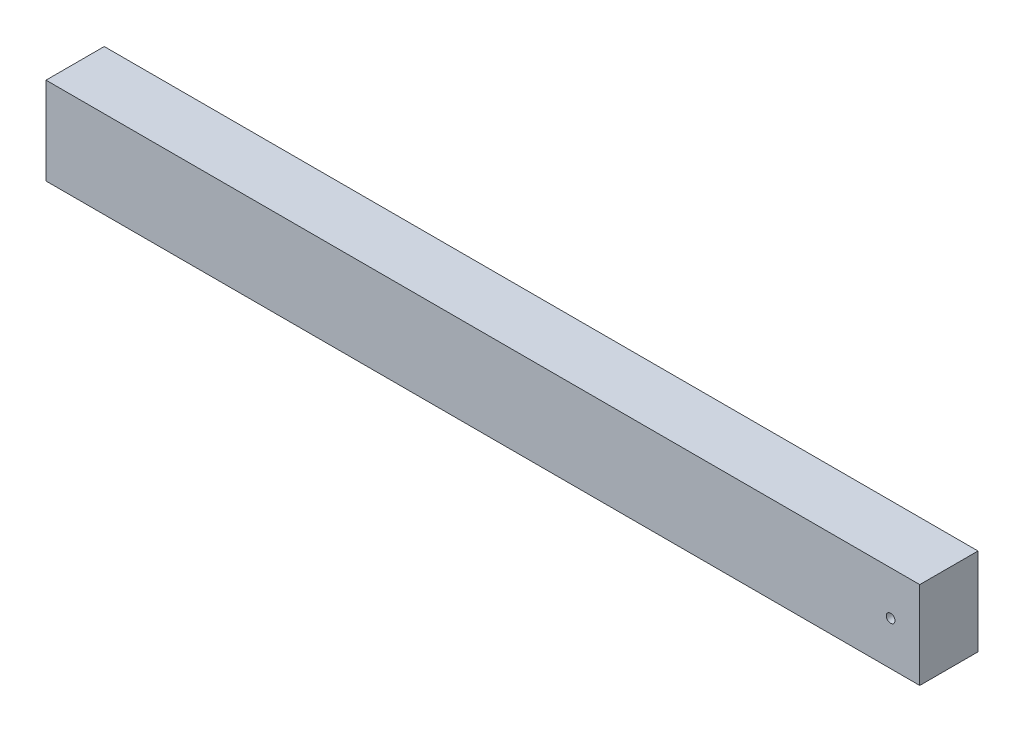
ISO-10303-21;
HEADER;
FILE_DESCRIPTION(('STEP AP214'),'2;1');
FILE_NAME('part.step','',(''),(''),'','','');
FILE_SCHEMA(('AUTOMOTIVE_DESIGN { 1 0 10303 214 1 1 1 1 }'));
ENDSEC;
DATA;
#1=APPLICATION_CONTEXT('core data for automotive mechanical design processes');
#2=APPLICATION_PROTOCOL_DEFINITION('international standard','automotive_design',2000,#1);
#3=PRODUCT_CONTEXT('',#1,'mechanical');
#4=PRODUCT('Part','Part','',(#3));
#5=PRODUCT_RELATED_PRODUCT_CATEGORY('part','',(#4));
#6=PRODUCT_DEFINITION_FORMATION('','',#4);
#7=PRODUCT_DEFINITION_CONTEXT('part definition',#1,'design');
#8=PRODUCT_DEFINITION('design','',#6,#7);
#9=PRODUCT_DEFINITION_SHAPE('','',#8);
#10=(LENGTH_UNIT() NAMED_UNIT(*) SI_UNIT(.MILLI.,.METRE.));
#11=(NAMED_UNIT(*) PLANE_ANGLE_UNIT() SI_UNIT($,.RADIAN.));
#12=(NAMED_UNIT(*) SI_UNIT($,.STERADIAN.) SOLID_ANGLE_UNIT());
#13=UNCERTAINTY_MEASURE_WITH_UNIT(LENGTH_MEASURE(1.E-05),#10,'distance_accuracy_value','');
#14=(GEOMETRIC_REPRESENTATION_CONTEXT(3) GLOBAL_UNCERTAINTY_ASSIGNED_CONTEXT((#13)) GLOBAL_UNIT_ASSIGNED_CONTEXT((#10,
#11,#12)) REPRESENTATION_CONTEXT('',''));
#15=CARTESIAN_POINT('',(0.,0.,0.));
#16=DIRECTION('',(0.,0.,1.));
#17=DIRECTION('',(1.,0.,0.));
#18=AXIS2_PLACEMENT_3D('',#15,#16,#17);
#19=CARTESIAN_POINT('',(0.,0.,20.));
#20=DIRECTION('',(0.,0.,1.));
#21=DIRECTION('',(1.,0.,0.));
#22=AXIS2_PLACEMENT_3D('',#19,#20,#21);
#23=PLANE('',#22);
#24=DIRECTION('',(0.,-1.,0.));
#25=VECTOR('',#24,1.);
#26=CARTESIAN_POINT('',(-300.,-30.,20.));
#27=LINE('',#26,#25);
#28=CARTESIAN_POINT('',(-300.,30.,20.));
#29=VERTEX_POINT('',#28);
#30=CARTESIAN_POINT('',(-300.,-30.,20.));
#31=VERTEX_POINT('',#30);
#32=EDGE_CURVE('E85',#29,#31,#27,.T.);
#33=ORIENTED_EDGE('',*,*,#32,.T.);
#34=DIRECTION('',(1.,0.,0.));
#35=VECTOR('',#34,1.);
#36=CARTESIAN_POINT('',(300.,-30.,20.));
#37=LINE('',#36,#35);
#38=CARTESIAN_POINT('',(300.,-30.,20.));
#39=VERTEX_POINT('',#38);
#40=EDGE_CURVE('E80',#31,#39,#37,.T.);
#41=ORIENTED_EDGE('',*,*,#40,.T.);
#42=DIRECTION('',(0.,1.,0.));
#43=VECTOR('',#42,1.);
#44=CARTESIAN_POINT('',(300.,-30.,20.));
#45=LINE('',#44,#43);
#46=CARTESIAN_POINT('',(300.,30.,20.));
#47=VERTEX_POINT('',#46);
#48=EDGE_CURVE('E83',#39,#47,#45,.T.);
#49=ORIENTED_EDGE('',*,*,#48,.T.);
#50=DIRECTION('',(-1.,0.,0.));
#51=VECTOR('',#50,1.);
#52=CARTESIAN_POINT('',(300.,30.,20.));
#53=LINE('',#52,#51);
#54=EDGE_CURVE('E50',#47,#29,#53,.T.);
#55=ORIENTED_EDGE('',*,*,#54,.T.);
#56=EDGE_LOOP('',(#33,#41,#49,#55));
#57=FACE_BOUND('',#56,.T.);
#58=CARTESIAN_POINT('',(280.,0.,20.));
#59=DIRECTION('',(0.,0.,1.));
#60=DIRECTION('',(1.,0.,0.));
#61=AXIS2_PLACEMENT_3D('',#58,#59,#60);
#62=CIRCLE('',#61,2.99999999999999);
#63=CARTESIAN_POINT('',(283.,0.,20.));
#64=VERTEX_POINT('',#63);
#65=EDGE_CURVE('E100',#64,#64,#62,.T.);
#66=ORIENTED_EDGE('',*,*,#65,.F.);
#67=EDGE_LOOP('',(#66));
#68=FACE_BOUND('',#67,.T.);
#69=ADVANCED_FACE('F33',(#57,#68),#23,.T.);
#70=CARTESIAN_POINT('',(0.,0.,-20.));
#71=DIRECTION('',(0.,0.,1.));
#72=DIRECTION('',(1.,0.,0.));
#73=AXIS2_PLACEMENT_3D('',#70,#71,#72);
#74=PLANE('',#73);
#75=DIRECTION('',(0.,-1.,0.));
#76=VECTOR('',#75,1.);
#77=CARTESIAN_POINT('',(-300.,-30.,-20.));
#78=LINE('',#77,#76);
#79=CARTESIAN_POINT('',(-300.,30.,-20.));
#80=VERTEX_POINT('',#79);
#81=CARTESIAN_POINT('',(-300.,-30.,-20.));
#82=VERTEX_POINT('',#81);
#83=EDGE_CURVE('E97',#80,#82,#78,.T.);
#84=ORIENTED_EDGE('',*,*,#83,.F.);
#85=DIRECTION('',(-1.,0.,0.));
#86=VECTOR('',#85,1.);
#87=CARTESIAN_POINT('',(300.,30.,-20.));
#88=LINE('',#87,#86);
#89=CARTESIAN_POINT('',(300.,30.,-20.));
#90=VERTEX_POINT('',#89);
#91=EDGE_CURVE('E73',#90,#80,#88,.T.);
#92=ORIENTED_EDGE('',*,*,#91,.F.);
#93=DIRECTION('',(0.,1.,0.));
#94=VECTOR('',#93,1.);
#95=CARTESIAN_POINT('',(300.,-30.,-20.));
#96=LINE('',#95,#94);
#97=CARTESIAN_POINT('',(300.,-30.,-20.));
#98=VERTEX_POINT('',#97);
#99=EDGE_CURVE('E67',#98,#90,#96,.T.);
#100=ORIENTED_EDGE('',*,*,#99,.F.);
#101=DIRECTION('',(1.,0.,0.));
#102=VECTOR('',#101,1.);
#103=CARTESIAN_POINT('',(300.,-30.,-20.));
#104=LINE('',#103,#102);
#105=EDGE_CURVE('E89',#82,#98,#104,.T.);
#106=ORIENTED_EDGE('',*,*,#105,.F.);
#107=EDGE_LOOP('',(#84,#92,#100,#106));
#108=FACE_BOUND('',#107,.T.);
#109=CARTESIAN_POINT('',(280.,0.,-20.));
#110=DIRECTION('',(0.,0.,1.));
#111=DIRECTION('',(1.,0.,0.));
#112=AXIS2_PLACEMENT_3D('',#109,#110,#111);
#113=CIRCLE('',#112,2.99999999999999);
#114=CARTESIAN_POINT('',(283.,0.,-20.));
#115=VERTEX_POINT('',#114);
#116=EDGE_CURVE('E112',#115,#115,#113,.T.);
#117=ORIENTED_EDGE('',*,*,#116,.T.);
#118=EDGE_LOOP('',(#117));
#119=FACE_BOUND('',#118,.T.);
#120=ADVANCED_FACE('F108',(#108,#119),#74,.F.);
#121=CARTESIAN_POINT('',(-300.,-30.,20.));
#122=DIRECTION('',(1.,0.,0.));
#123=DIRECTION('',(0.,0.,-1.));
#124=AXIS2_PLACEMENT_3D('',#121,#122,#123);
#125=PLANE('',#124);
#126=ORIENTED_EDGE('',*,*,#83,.T.);
#127=DIRECTION('',(0.,0.,-1.));
#128=VECTOR('',#127,1.);
#129=CARTESIAN_POINT('',(-300.,-30.,20.));
#130=LINE('',#129,#128);
#131=EDGE_CURVE('E11',#31,#82,#130,.T.);
#132=ORIENTED_EDGE('',*,*,#131,.F.);
#133=ORIENTED_EDGE('',*,*,#32,.F.);
#134=DIRECTION('',(0.,0.,-1.));
#135=VECTOR('',#134,1.);
#136=CARTESIAN_POINT('',(-300.,30.,20.));
#137=LINE('',#136,#135);
#138=EDGE_CURVE('E93',#29,#80,#137,.T.);
#139=ORIENTED_EDGE('',*,*,#138,.T.);
#140=EDGE_LOOP('',(#126,#132,#133,#139));
#141=FACE_BOUND('',#140,.T.);
#142=ADVANCED_FACE('F35',(#141),#125,.F.);
#143=CARTESIAN_POINT('',(300.,-30.,20.));
#144=DIRECTION('',(0.,1.,0.));
#145=DIRECTION('',(-1.,0.,0.));
#146=AXIS2_PLACEMENT_3D('',#143,#144,#145);
#147=PLANE('',#146);
#148=ORIENTED_EDGE('',*,*,#105,.T.);
#149=DIRECTION('',(0.,0.,-1.));
#150=VECTOR('',#149,1.);
#151=CARTESIAN_POINT('',(300.,-30.,20.));
#152=LINE('',#151,#150);
#153=EDGE_CURVE('E42',#39,#98,#152,.T.);
#154=ORIENTED_EDGE('',*,*,#153,.F.);
#155=ORIENTED_EDGE('',*,*,#40,.F.);
#156=ORIENTED_EDGE('',*,*,#131,.T.);
#157=EDGE_LOOP('',(#148,#154,#155,#156));
#158=FACE_BOUND('',#157,.T.);
#159=ADVANCED_FACE('F88',(#158),#147,.F.);
#160=CARTESIAN_POINT('',(300.,-30.,20.));
#161=DIRECTION('',(-1.,0.,0.));
#162=DIRECTION('',(0.,0.,1.));
#163=AXIS2_PLACEMENT_3D('',#160,#161,#162);
#164=PLANE('',#163);
#165=ORIENTED_EDGE('',*,*,#99,.T.);
#166=DIRECTION('',(0.,0.,-1.));
#167=VECTOR('',#166,1.);
#168=CARTESIAN_POINT('',(300.,30.,20.));
#169=LINE('',#168,#167);
#170=EDGE_CURVE('E90',#47,#90,#169,.T.);
#171=ORIENTED_EDGE('',*,*,#170,.F.);
#172=ORIENTED_EDGE('',*,*,#48,.F.);
#173=ORIENTED_EDGE('',*,*,#153,.T.);
#174=EDGE_LOOP('',(#165,#171,#172,#173));
#175=FACE_BOUND('',#174,.T.);
#176=ADVANCED_FACE('F91',(#175),#164,.F.);
#177=CARTESIAN_POINT('',(300.,30.,20.));
#178=DIRECTION('',(0.,-1.,0.));
#179=DIRECTION('',(1.,0.,0.));
#180=AXIS2_PLACEMENT_3D('',#177,#178,#179);
#181=PLANE('',#180);
#182=ORIENTED_EDGE('',*,*,#91,.T.);
#183=ORIENTED_EDGE('',*,*,#138,.F.);
#184=ORIENTED_EDGE('',*,*,#54,.F.);
#185=ORIENTED_EDGE('',*,*,#170,.T.);
#186=EDGE_LOOP('',(#182,#183,#184,#185));
#187=FACE_BOUND('',#186,.T.);
#188=ADVANCED_FACE('F105',(#187),#181,.F.);
#189=CARTESIAN_POINT('',(280.,0.,20.));
#190=DIRECTION('',(0.,0.,-1.));
#191=DIRECTION('',(-1.,0.,0.));
#192=AXIS2_PLACEMENT_3D('',#189,#190,#191);
#193=CYLINDRICAL_SURFACE('',#192,2.99999999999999);
#194=ORIENTED_EDGE('',*,*,#65,.T.);
#195=EDGE_LOOP('',(#194));
#196=FACE_BOUND('',#195,.T.);
#197=ORIENTED_EDGE('',*,*,#116,.F.);
#198=EDGE_LOOP('',(#197));
#199=FACE_BOUND('',#198,.T.);
#200=ADVANCED_FACE('F118',(#196,#199),#193,.F.);
#201=CLOSED_SHELL('',(#69,#120,#142,#159,#176,#188,#200));
#202=MANIFOLD_SOLID_BREP('B2',#201);
#203=ADVANCED_BREP_SHAPE_REPRESENTATION('',(#18,#202),#14);
#204=SHAPE_DEFINITION_REPRESENTATION(#9,#203);
ENDSEC;
END-ISO-10303-21;
